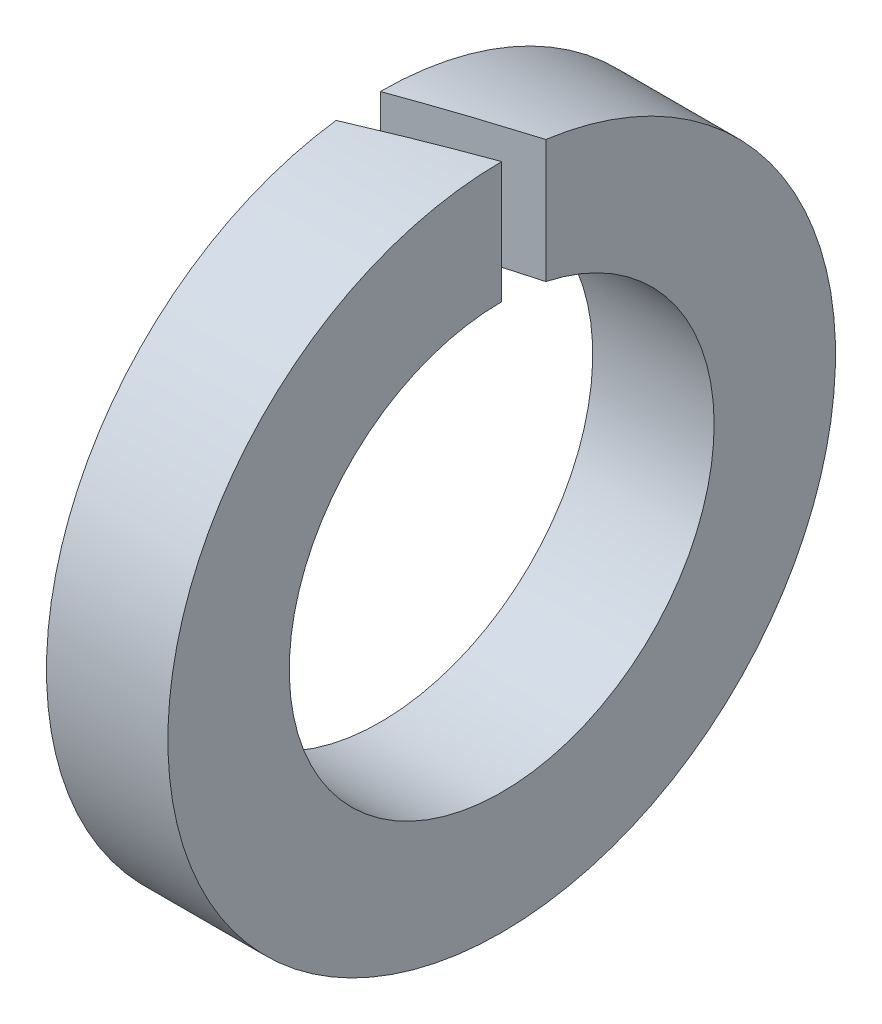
ISO-10303-21;
HEADER;
FILE_DESCRIPTION(('STEP AP214'),'2;1');
FILE_NAME('part.step','',(''),(''),'','','');
FILE_SCHEMA(('AUTOMOTIVE_DESIGN { 1 0 10303 214 1 1 1 1 }'));
ENDSEC;
DATA;
#1=APPLICATION_CONTEXT('core data for automotive mechanical design processes');
#2=APPLICATION_PROTOCOL_DEFINITION('international standard','automotive_design',2000,#1);
#3=PRODUCT_CONTEXT('',#1,'mechanical');
#4=PRODUCT('Part','Part','',(#3));
#5=PRODUCT_RELATED_PRODUCT_CATEGORY('part','',(#4));
#6=PRODUCT_DEFINITION_FORMATION('','',#4);
#7=PRODUCT_DEFINITION_CONTEXT('part definition',#1,'design');
#8=PRODUCT_DEFINITION('design','',#6,#7);
#9=PRODUCT_DEFINITION_SHAPE('','',#8);
#10=(LENGTH_UNIT() NAMED_UNIT(*) SI_UNIT(.MILLI.,.METRE.));
#11=(NAMED_UNIT(*) PLANE_ANGLE_UNIT() SI_UNIT($,.RADIAN.));
#12=(NAMED_UNIT(*) SI_UNIT($,.STERADIAN.) SOLID_ANGLE_UNIT());
#13=UNCERTAINTY_MEASURE_WITH_UNIT(LENGTH_MEASURE(1.E-05),#10,'distance_accuracy_value','');
#14=(GEOMETRIC_REPRESENTATION_CONTEXT(3) GLOBAL_UNCERTAINTY_ASSIGNED_CONTEXT((#13)) GLOBAL_UNIT_ASSIGNED_CONTEXT((#10,
#11,#12)) REPRESENTATION_CONTEXT('',''));
#15=CARTESIAN_POINT('',(0.,0.,0.));
#16=DIRECTION('',(0.,0.,1.));
#17=DIRECTION('',(1.,0.,0.));
#18=AXIS2_PLACEMENT_3D('',#15,#16,#17);
#19=CARTESIAN_POINT('',(0.,0.,-8.25));
#20=DIRECTION('',(1.,0.,0.));
#21=DIRECTION('',(0.,0.,-1.));
#22=AXIS2_PLACEMENT_3D('',#19,#20,#21);
#23=PLANE('',#22);
#24=DIRECTION('',(0.,-1.,0.));
#25=VECTOR('',#24,1.);
#26=CARTESIAN_POINT('',(0.,8.25,1.09191070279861));
#27=LINE('',#26,#25);
#28=CARTESIAN_POINT('',(0.,8.17742202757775,1.09191070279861));
#29=VERTEX_POINT('',#28);
#30=CARTESIAN_POINT('',(0.,5.13519532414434,1.09191070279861));
#31=VERTEX_POINT('',#30);
#32=EDGE_CURVE('E52',#29,#31,#27,.T.);
#33=ORIENTED_EDGE('',*,*,#32,.T.);
#34=CARTESIAN_POINT('',(0.,0.,0.));
#35=DIRECTION('',(-1.,0.,0.));
#36=DIRECTION('',(0.,0.,1.));
#37=AXIS2_PLACEMENT_3D('',#34,#35,#36);
#38=CIRCLE('',#37,5.25);
#39=CARTESIAN_POINT('',(0.,5.25,0.));
#40=VERTEX_POINT('',#39);
#41=EDGE_CURVE('E86',#40,#31,#38,.T.);
#42=ORIENTED_EDGE('',*,*,#41,.F.);
#43=DIRECTION('',(0.,-1.,0.));
#44=VECTOR('',#43,1.);
#45=CARTESIAN_POINT('',(0.,8.25,0.));
#46=LINE('',#45,#44);
#47=CARTESIAN_POINT('',(0.,8.25,0.));
#48=VERTEX_POINT('',#47);
#49=EDGE_CURVE('E95',#48,#40,#46,.T.);
#50=ORIENTED_EDGE('',*,*,#49,.F.);
#51=CARTESIAN_POINT('',(0.,0.,0.));
#52=DIRECTION('',(-1.,0.,0.));
#53=DIRECTION('',(0.,0.,1.));
#54=AXIS2_PLACEMENT_3D('',#51,#52,#53);
#55=CIRCLE('',#54,8.25);
#56=EDGE_CURVE('E84',#48,#29,#55,.T.);
#57=ORIENTED_EDGE('',*,*,#56,.T.);
#58=EDGE_LOOP('',(#33,#42,#50,#57));
#59=FACE_BOUND('',#58,.T.);
#60=ADVANCED_FACE('F31',(#59),#23,.F.);
#61=CARTESIAN_POINT('',(0.,0.,0.));
#62=DIRECTION('',(-1.,0.,0.));
#63=DIRECTION('',(0.,0.,1.));
#64=AXIS2_PLACEMENT_3D('',#61,#62,#63);
#65=CYLINDRICAL_SURFACE('',#64,5.25);
#66=CARTESIAN_POINT('',(3.00000000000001,0.,0.));
#67=DIRECTION('',(-0.34202014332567,0.,-0.939692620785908));
#68=DIRECTION('',(-0.939692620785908,0.,0.34202014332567));
#69=AXIS2_PLACEMENT_3D('',#66,#67,#68);
#70=ELLIPSE('',#69,15.3499731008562,5.25);
#71=CARTESIAN_POINT('',(3.00000000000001,5.25,0.));
#72=VERTEX_POINT('',#71);
#73=EDGE_CURVE('E88',#72,#31,#70,.F.);
#74=ORIENTED_EDGE('',*,*,#73,.F.);
#75=CARTESIAN_POINT('',(3.,0.,0.));
#76=DIRECTION('',(-1.,0.,0.));
#77=DIRECTION('',(0.,0.,1.));
#78=AXIS2_PLACEMENT_3D('',#75,#76,#77);
#79=CIRCLE('',#78,5.25);
#80=CARTESIAN_POINT('',(3.00000000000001,5.13519532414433,-1.09191070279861));
#81=VERTEX_POINT('',#80);
#82=EDGE_CURVE('E81',#81,#72,#79,.T.);
#83=ORIENTED_EDGE('',*,*,#82,.F.);
#84=CARTESIAN_POINT('',(0.,0.,0.));
#85=DIRECTION('',(0.342020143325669,0.,0.939692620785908));
#86=DIRECTION('',(-0.939692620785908,0.,0.34202014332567));
#87=AXIS2_PLACEMENT_3D('',#84,#85,#86);
#88=ELLIPSE('',#87,15.3499731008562,5.25);
#89=EDGE_CURVE('E103',#40,#81,#88,.F.);
#90=ORIENTED_EDGE('',*,*,#89,.F.);
#91=ORIENTED_EDGE('',*,*,#41,.T.);
#92=EDGE_LOOP('',(#74,#83,#90,#91));
#93=FACE_BOUND('',#92,.T.);
#94=ADVANCED_FACE('F105',(#93),#65,.F.);
#95=CARTESIAN_POINT('',(3.,0.,-8.25));
#96=DIRECTION('',(-1.,0.,0.));
#97=DIRECTION('',(0.,0.,1.));
#98=AXIS2_PLACEMENT_3D('',#95,#96,#97);
#99=PLANE('',#98);
#100=DIRECTION('',(0.,-1.,0.));
#101=VECTOR('',#100,1.);
#102=CARTESIAN_POINT('',(3.00000000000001,8.25,0.));
#103=LINE('',#102,#101);
#104=CARTESIAN_POINT('',(3.00000000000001,8.25,0.));
#105=VERTEX_POINT('',#104);
#106=EDGE_CURVE('E69',#105,#72,#103,.T.);
#107=ORIENTED_EDGE('',*,*,#106,.F.);
#108=CARTESIAN_POINT('',(3.,0.,0.));
#109=DIRECTION('',(-1.,0.,0.));
#110=DIRECTION('',(0.,0.,1.));
#111=AXIS2_PLACEMENT_3D('',#108,#109,#110);
#112=CIRCLE('',#111,8.25);
#113=CARTESIAN_POINT('',(3.,8.17742202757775,-1.09191070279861));
#114=VERTEX_POINT('',#113);
#115=EDGE_CURVE('E79',#114,#105,#112,.T.);
#116=ORIENTED_EDGE('',*,*,#115,.F.);
#117=DIRECTION('',(0.,-1.,0.));
#118=VECTOR('',#117,1.);
#119=CARTESIAN_POINT('',(3.00000000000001,8.25,-1.09191070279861));
#120=LINE('',#119,#118);
#121=EDGE_CURVE('E45',#114,#81,#120,.T.);
#122=ORIENTED_EDGE('',*,*,#121,.T.);
#123=ORIENTED_EDGE('',*,*,#82,.T.);
#124=EDGE_LOOP('',(#107,#116,#122,#123));
#125=FACE_BOUND('',#124,.T.);
#126=ADVANCED_FACE('F78',(#125),#99,.F.);
#127=CARTESIAN_POINT('',(0.,0.,0.));
#128=DIRECTION('',(-1.,0.,0.));
#129=DIRECTION('',(0.,0.,1.));
#130=AXIS2_PLACEMENT_3D('',#127,#128,#129);
#131=CYLINDRICAL_SURFACE('',#130,8.25);
#132=CARTESIAN_POINT('',(3.00000000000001,0.,0.));
#133=DIRECTION('',(-0.34202014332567,0.,-0.939692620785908));
#134=DIRECTION('',(-0.939692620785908,0.,0.34202014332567));
#135=AXIS2_PLACEMENT_3D('',#132,#133,#134);
#136=ELLIPSE('',#135,24.1213863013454,8.25);
#137=EDGE_CURVE('E11',#29,#105,#136,.T.);
#138=ORIENTED_EDGE('',*,*,#137,.F.);
#139=ORIENTED_EDGE('',*,*,#56,.F.);
#140=CARTESIAN_POINT('',(0.,0.,0.));
#141=DIRECTION('',(0.342020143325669,0.,0.939692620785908));
#142=DIRECTION('',(-0.939692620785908,0.,0.34202014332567));
#143=AXIS2_PLACEMENT_3D('',#140,#141,#142);
#144=ELLIPSE('',#143,24.1213863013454,8.25);
#145=EDGE_CURVE('E38',#114,#48,#144,.T.);
#146=ORIENTED_EDGE('',*,*,#145,.F.);
#147=ORIENTED_EDGE('',*,*,#115,.T.);
#148=EDGE_LOOP('',(#138,#139,#146,#147));
#149=FACE_BOUND('',#148,.T.);
#150=ADVANCED_FACE('F83',(#149),#131,.T.);
#151=CARTESIAN_POINT('',(0.,8.25,0.));
#152=DIRECTION('',(0.342020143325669,0.,0.939692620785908));
#153=DIRECTION('',(0.939692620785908,0.,-0.342020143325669));
#154=AXIS2_PLACEMENT_3D('',#151,#152,#153);
#155=PLANE('',#154);
#156=ORIENTED_EDGE('',*,*,#89,.T.);
#157=ORIENTED_EDGE('',*,*,#121,.F.);
#158=ORIENTED_EDGE('',*,*,#145,.T.);
#159=ORIENTED_EDGE('',*,*,#49,.T.);
#160=EDGE_LOOP('',(#156,#157,#158,#159));
#161=FACE_BOUND('',#160,.T.);
#162=ADVANCED_FACE('F94',(#161),#155,.T.);
#163=CARTESIAN_POINT('',(3.00000000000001,8.25,0.));
#164=DIRECTION('',(-0.34202014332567,0.,-0.939692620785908));
#165=DIRECTION('',(-0.939692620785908,0.,0.34202014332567));
#166=AXIS2_PLACEMENT_3D('',#163,#164,#165);
#167=PLANE('',#166);
#168=ORIENTED_EDGE('',*,*,#73,.T.);
#169=ORIENTED_EDGE('',*,*,#32,.F.);
#170=ORIENTED_EDGE('',*,*,#137,.T.);
#171=ORIENTED_EDGE('',*,*,#106,.T.);
#172=EDGE_LOOP('',(#168,#169,#170,#171));
#173=FACE_BOUND('',#172,.T.);
#174=ADVANCED_FACE('F68',(#173),#167,.T.);
#175=CLOSED_SHELL('',(#60,#94,#126,#150,#162,#174));
#176=MANIFOLD_SOLID_BREP('B2',#175);
#177=ADVANCED_BREP_SHAPE_REPRESENTATION('',(#18,#176),#14);
#178=SHAPE_DEFINITION_REPRESENTATION(#9,#177);
ENDSEC;
END-ISO-10303-21;
